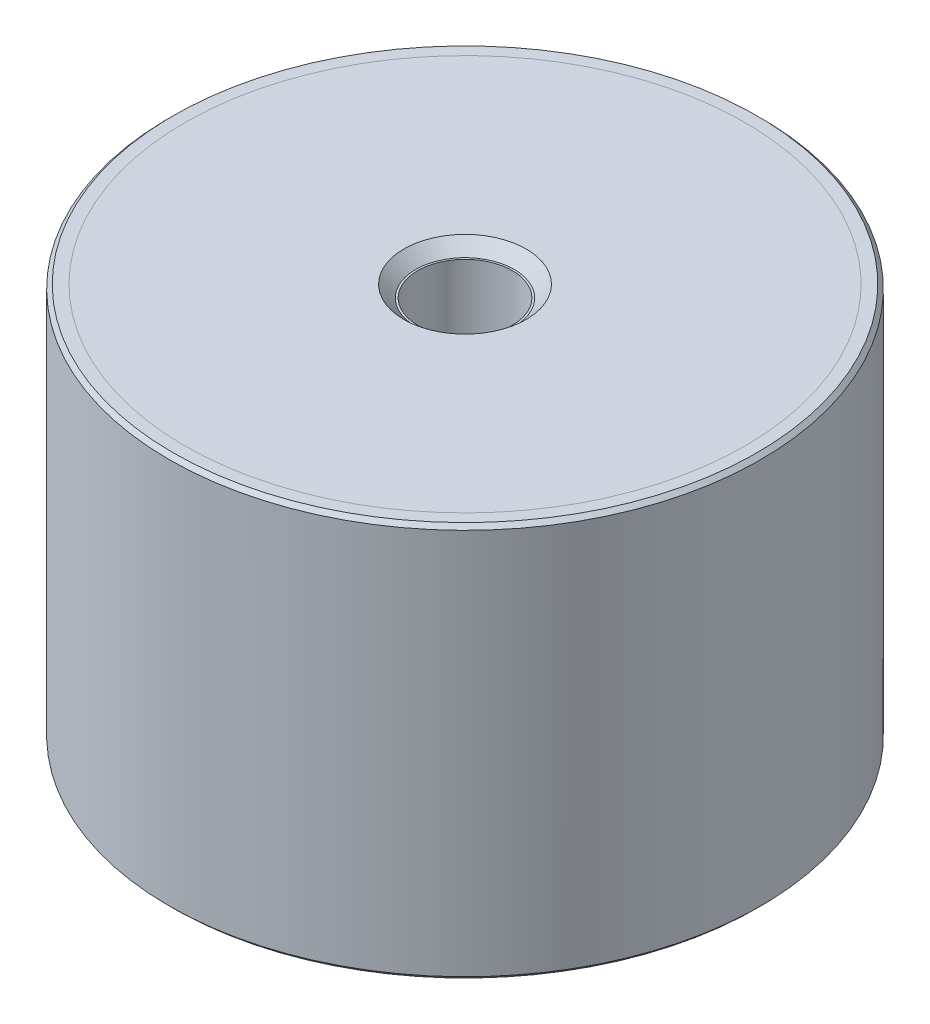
ISO-10303-21;
HEADER;
FILE_DESCRIPTION(('STEP AP214'),'2;1');
FILE_NAME('part.step','',(''),(''),'','','');
FILE_SCHEMA(('AUTOMOTIVE_DESIGN { 1 0 10303 214 1 1 1 1 }'));
ENDSEC;
DATA;
#1=APPLICATION_CONTEXT('core data for automotive mechanical design processes');
#2=APPLICATION_PROTOCOL_DEFINITION('international standard','automotive_design',2000,#1);
#3=PRODUCT_CONTEXT('',#1,'mechanical');
#4=PRODUCT('Part','Part','',(#3));
#5=PRODUCT_RELATED_PRODUCT_CATEGORY('part','',(#4));
#6=PRODUCT_DEFINITION_FORMATION('','',#4);
#7=PRODUCT_DEFINITION_CONTEXT('part definition',#1,'design');
#8=PRODUCT_DEFINITION('design','',#6,#7);
#9=PRODUCT_DEFINITION_SHAPE('','',#8);
#10=(LENGTH_UNIT() NAMED_UNIT(*) SI_UNIT(.MILLI.,.METRE.));
#11=(NAMED_UNIT(*) PLANE_ANGLE_UNIT() SI_UNIT($,.RADIAN.));
#12=(NAMED_UNIT(*) SI_UNIT($,.STERADIAN.) SOLID_ANGLE_UNIT());
#13=UNCERTAINTY_MEASURE_WITH_UNIT(LENGTH_MEASURE(1.E-05),#10,'distance_accuracy_value','');
#14=(GEOMETRIC_REPRESENTATION_CONTEXT(3) GLOBAL_UNCERTAINTY_ASSIGNED_CONTEXT((#13)) GLOBAL_UNIT_ASSIGNED_CONTEXT((#10,
#11,#12)) REPRESENTATION_CONTEXT('',''));
#15=CARTESIAN_POINT('',(0.,0.,0.));
#16=DIRECTION('',(0.,0.,1.));
#17=DIRECTION('',(1.,0.,0.));
#18=AXIS2_PLACEMENT_3D('',#15,#16,#17);
#19=CARTESIAN_POINT('',(0.,-47.,6.));
#20=DIRECTION('',(0.,1.,0.));
#21=DIRECTION('',(0.,0.,1.));
#22=AXIS2_PLACEMENT_3D('',#19,#20,#21);
#23=PLANE('',#22);
#24=CARTESIAN_POINT('',(0.,-47.,0.));
#25=DIRECTION('',(0.,1.,0.));
#26=DIRECTION('',(0.,0.,1.));
#27=AXIS2_PLACEMENT_3D('',#24,#25,#26);
#28=CIRCLE('',#27,6.25000000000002);
#29=CARTESIAN_POINT('',(0.,-47.,6.25000000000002));
#30=VERTEX_POINT('',#29);
#31=EDGE_CURVE('P0_E10',#30,#30,#28,.F.);
#32=ORIENTED_EDGE('',*,*,#31,.T.);
#33=EDGE_LOOP('',(#32));
#34=FACE_BOUND('',#33,.T.);
#35=CARTESIAN_POINT('',(0.,-47.,0.));
#36=DIRECTION('',(0.,1.,0.));
#37=DIRECTION('',(0.,0.,1.));
#38=AXIS2_PLACEMENT_3D('',#35,#36,#37);
#39=CIRCLE('',#38,35.5);
#40=CARTESIAN_POINT('',(0.,-47.,35.5));
#41=VERTEX_POINT('',#40);
#42=EDGE_CURVE('P0_E25',#41,#41,#39,.T.);
#43=ORIENTED_EDGE('',*,*,#42,.T.);
#44=EDGE_LOOP('',(#43));
#45=FACE_BOUND('',#44,.T.);
#46=ADVANCED_FACE('P0_F14',(#34,#45),#23,.T.);
#47=CARTESIAN_POINT('',(0.,21.0340428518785,0.));
#48=DIRECTION('',(0.,1.,0.));
#49=DIRECTION('',(0.,0.,1.));
#50=AXIS2_PLACEMENT_3D('',#47,#48,#49);
#51=CYLINDRICAL_SURFACE('',#50,35.5);
#52=CARTESIAN_POINT('',(0.,-48.5,0.));
#53=DIRECTION('',(0.,1.,0.));
#54=DIRECTION('',(0.,0.,1.));
#55=AXIS2_PLACEMENT_3D('',#52,#53,#54);
#56=CIRCLE('',#55,35.5);
#57=CARTESIAN_POINT('',(0.,-48.5,35.5));
#58=VERTEX_POINT('',#57);
#59=EDGE_CURVE('P0_E29',#58,#58,#56,.T.);
#60=ORIENTED_EDGE('',*,*,#59,.T.);
#61=EDGE_LOOP('',(#60));
#62=FACE_BOUND('',#61,.T.);
#63=ORIENTED_EDGE('',*,*,#42,.F.);
#64=EDGE_LOOP('',(#63));
#65=FACE_BOUND('',#64,.T.);
#66=ADVANCED_FACE('P0_F35',(#62,#65),#51,.T.);
#67=CARTESIAN_POINT('',(0.,-48.5,35.5));
#68=DIRECTION('',(0.,-1.,0.));
#69=DIRECTION('',(0.,0.,-1.));
#70=AXIS2_PLACEMENT_3D('',#67,#68,#69);
#71=PLANE('',#70);
#72=CARTESIAN_POINT('',(0.,-48.5,0.));
#73=DIRECTION('',(0.,-1.,0.));
#74=DIRECTION('',(0.,0.,-1.));
#75=AXIS2_PLACEMENT_3D('',#72,#73,#74);
#76=CIRCLE('',#75,7.75000000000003);
#77=CARTESIAN_POINT('',(0.,-48.5,-7.75000000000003));
#78=VERTEX_POINT('',#77);
#79=EDGE_CURVE('P0_E21',#78,#78,#76,.F.);
#80=ORIENTED_EDGE('',*,*,#79,.T.);
#81=EDGE_LOOP('',(#80));
#82=FACE_BOUND('',#81,.T.);
#83=ORIENTED_EDGE('',*,*,#59,.F.);
#84=EDGE_LOOP('',(#83));
#85=FACE_BOUND('',#84,.T.);
#86=ADVANCED_FACE('P0_F38',(#82,#85),#71,.T.);
#87=CARTESIAN_POINT('',(0.,-48.5,0.));
#88=DIRECTION('',(0.,-1.,0.));
#89=DIRECTION('',(0.,0.,-1.));
#90=AXIS2_PLACEMENT_3D('',#87,#88,#89);
#91=CONICAL_SURFACE('',#90,7.75000000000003,0.785398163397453);
#92=ORIENTED_EDGE('',*,*,#31,.F.);
#93=EDGE_LOOP('',(#92));
#94=FACE_BOUND('',#93,.T.);
#95=ORIENTED_EDGE('',*,*,#79,.F.);
#96=EDGE_LOOP('',(#95));
#97=FACE_BOUND('',#96,.T.);
#98=ADVANCED_FACE('P0_F16',(#94,#97),#91,.F.);
#99=CLOSED_SHELL('',(#46,#66,#86,#98));
#100=MANIFOLD_SOLID_BREP('P0_B1',#99);
#101=CARTESIAN_POINT('',(0.,1.5,6.));
#102=DIRECTION('',(0.,1.,0.));
#103=DIRECTION('',(0.,0.,1.));
#104=AXIS2_PLACEMENT_3D('',#101,#102,#103);
#105=PLANE('',#104);
#106=CARTESIAN_POINT('',(0.,1.5,0.));
#107=DIRECTION('',(0.,1.,0.));
#108=DIRECTION('',(0.,0.,1.));
#109=AXIS2_PLACEMENT_3D('',#106,#107,#108);
#110=CIRCLE('',#109,7.75000000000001);
#111=CARTESIAN_POINT('',(0.,1.5,7.75000000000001));
#112=VERTEX_POINT('',#111);
#113=EDGE_CURVE('P1_E10',#112,#112,#110,.F.);
#114=ORIENTED_EDGE('',*,*,#113,.T.);
#115=EDGE_LOOP('',(#114));
#116=FACE_BOUND('',#115,.T.);
#117=CARTESIAN_POINT('',(0.,1.5,0.));
#118=DIRECTION('',(0.,1.,0.));
#119=DIRECTION('',(0.,0.,1.));
#120=AXIS2_PLACEMENT_3D('',#117,#118,#119);
#121=CIRCLE('',#120,35.5);
#122=CARTESIAN_POINT('',(0.,1.5,35.5));
#123=VERTEX_POINT('',#122);
#124=EDGE_CURVE('P1_E25',#123,#123,#121,.T.);
#125=ORIENTED_EDGE('',*,*,#124,.T.);
#126=EDGE_LOOP('',(#125));
#127=FACE_BOUND('',#126,.T.);
#128=ADVANCED_FACE('P1_F14',(#116,#127),#105,.T.);
#129=CARTESIAN_POINT('',(0.,69.5340428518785,0.));
#130=DIRECTION('',(0.,1.,0.));
#131=DIRECTION('',(0.,0.,1.));
#132=AXIS2_PLACEMENT_3D('',#129,#130,#131);
#133=CYLINDRICAL_SURFACE('',#132,35.5);
#134=CARTESIAN_POINT('',(0.,0.,0.));
#135=DIRECTION('',(0.,1.,0.));
#136=DIRECTION('',(0.,0.,1.));
#137=AXIS2_PLACEMENT_3D('',#134,#135,#136);
#138=CIRCLE('',#137,35.5);
#139=CARTESIAN_POINT('',(0.,0.,35.5));
#140=VERTEX_POINT('',#139);
#141=EDGE_CURVE('P1_E29',#140,#140,#138,.T.);
#142=ORIENTED_EDGE('',*,*,#141,.T.);
#143=EDGE_LOOP('',(#142));
#144=FACE_BOUND('',#143,.T.);
#145=ORIENTED_EDGE('',*,*,#124,.F.);
#146=EDGE_LOOP('',(#145));
#147=FACE_BOUND('',#146,.T.);
#148=ADVANCED_FACE('P1_F35',(#144,#147),#133,.T.);
#149=CARTESIAN_POINT('',(0.,0.,35.5));
#150=DIRECTION('',(0.,-1.,0.));
#151=DIRECTION('',(0.,0.,-1.));
#152=AXIS2_PLACEMENT_3D('',#149,#150,#151);
#153=PLANE('',#152);
#154=CARTESIAN_POINT('',(0.,0.,0.));
#155=DIRECTION('',(0.,-1.,0.));
#156=DIRECTION('',(0.,0.,-1.));
#157=AXIS2_PLACEMENT_3D('',#154,#155,#156);
#158=CIRCLE('',#157,6.25000000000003);
#159=CARTESIAN_POINT('',(0.,0.,-6.25000000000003));
#160=VERTEX_POINT('',#159);
#161=EDGE_CURVE('P1_E21',#160,#160,#158,.F.);
#162=ORIENTED_EDGE('',*,*,#161,.T.);
#163=EDGE_LOOP('',(#162));
#164=FACE_BOUND('',#163,.T.);
#165=ORIENTED_EDGE('',*,*,#141,.F.);
#166=EDGE_LOOP('',(#165));
#167=FACE_BOUND('',#166,.T.);
#168=ADVANCED_FACE('P1_F38',(#164,#167),#153,.T.);
#169=CARTESIAN_POINT('',(0.,-0.250000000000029,0.));
#170=DIRECTION('',(0.,1.,0.));
#171=DIRECTION('',(0.,0.,1.));
#172=AXIS2_PLACEMENT_3D('',#169,#170,#171);
#173=CONICAL_SURFACE('',#172,6.,0.785398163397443);
#174=ORIENTED_EDGE('',*,*,#113,.F.);
#175=EDGE_LOOP('',(#174));
#176=FACE_BOUND('',#175,.T.);
#177=ORIENTED_EDGE('',*,*,#161,.F.);
#178=EDGE_LOOP('',(#177));
#179=FACE_BOUND('',#178,.T.);
#180=ADVANCED_FACE('P1_F16',(#176,#179),#173,.F.);
#181=CLOSED_SHELL('',(#128,#148,#168,#180));
#182=MANIFOLD_SOLID_BREP('P1_B1',#181);
#183=CARTESIAN_POINT('',(0.,0.,0.));
#184=DIRECTION('',(0.,1.,0.));
#185=DIRECTION('',(0.,0.,1.));
#186=AXIS2_PLACEMENT_3D('',#183,#184,#185);
#187=PLANE('',#186);
#188=CARTESIAN_POINT('',(0.,0.,0.));
#189=DIRECTION('',(0.,1.,0.));
#190=DIRECTION('',(0.,0.,1.));
#191=AXIS2_PLACEMENT_3D('',#188,#189,#190);
#192=CIRCLE('',#191,6.);
#193=CARTESIAN_POINT('',(0.,0.,6.));
#194=VERTEX_POINT('',#193);
#195=EDGE_CURVE('P2_E46',#194,#194,#192,.T.);
#196=ORIENTED_EDGE('',*,*,#195,.F.);
#197=EDGE_LOOP('',(#196));
#198=FACE_BOUND('',#197,.T.);
#199=CARTESIAN_POINT('',(0.,0.,0.));
#200=DIRECTION('',(0.,1.,0.));
#201=DIRECTION('',(0.,0.,1.));
#202=AXIS2_PLACEMENT_3D('',#199,#200,#201);
#203=CIRCLE('',#202,35.5);
#204=CARTESIAN_POINT('',(0.,0.,35.5));
#205=VERTEX_POINT('',#204);
#206=EDGE_CURVE('P2_E33',#205,#205,#203,.T.);
#207=ORIENTED_EDGE('',*,*,#206,.T.);
#208=EDGE_LOOP('',(#207));
#209=FACE_BOUND('',#208,.T.);
#210=ADVANCED_FACE('P2_F13',(#198,#209),#187,.T.);
#211=CARTESIAN_POINT('',(0.,65.5134936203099,0.));
#212=DIRECTION('',(0.,1.,0.));
#213=DIRECTION('',(0.,0.,1.));
#214=AXIS2_PLACEMENT_3D('',#211,#212,#213);
#215=CYLINDRICAL_SURFACE('',#214,35.5);
#216=CARTESIAN_POINT('',(0.,1.5,0.));
#217=DIRECTION('',(0.,1.,0.));
#218=DIRECTION('',(0.,0.,1.));
#219=AXIS2_PLACEMENT_3D('',#216,#217,#218);
#220=CIRCLE('',#219,35.5);
#221=CARTESIAN_POINT('',(0.,1.5,35.5));
#222=VERTEX_POINT('',#221);
#223=EDGE_CURVE('P2_E36',#222,#222,#220,.T.);
#224=ORIENTED_EDGE('',*,*,#223,.T.);
#225=EDGE_LOOP('',(#224));
#226=FACE_BOUND('',#225,.T.);
#227=ORIENTED_EDGE('',*,*,#206,.F.);
#228=EDGE_LOOP('',(#227));
#229=FACE_BOUND('',#228,.T.);
#230=ADVANCED_FACE('P2_F92',(#226,#229),#215,.F.);
#231=CARTESIAN_POINT('',(0.,1.5,35.5));
#232=DIRECTION('',(0.,1.,0.));
#233=DIRECTION('',(0.,0.,1.));
#234=AXIS2_PLACEMENT_3D('',#231,#232,#233);
#235=PLANE('',#234);
#236=CARTESIAN_POINT('',(0.,1.5,0.));
#237=DIRECTION('',(0.,1.,0.));
#238=DIRECTION('',(0.,0.,1.));
#239=AXIS2_PLACEMENT_3D('',#236,#237,#238);
#240=CIRCLE('',#239,37.);
#241=CARTESIAN_POINT('',(0.,1.5,37.));
#242=VERTEX_POINT('',#241);
#243=EDGE_CURVE('P2_E9',#242,#242,#240,.T.);
#244=ORIENTED_EDGE('',*,*,#243,.T.);
#245=EDGE_LOOP('',(#244));
#246=FACE_BOUND('',#245,.T.);
#247=ORIENTED_EDGE('',*,*,#223,.F.);
#248=EDGE_LOOP('',(#247));
#249=FACE_BOUND('',#248,.T.);
#250=ADVANCED_FACE('P2_F88',(#246,#249),#235,.T.);
#251=CARTESIAN_POINT('',(0.,65.5134936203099,0.));
#252=DIRECTION('',(0.,1.,0.));
#253=DIRECTION('',(0.,0.,1.));
#254=AXIS2_PLACEMENT_3D('',#251,#252,#253);
#255=CYLINDRICAL_SURFACE('',#254,37.5);
#256=CARTESIAN_POINT('',(0.,-48.,0.));
#257=DIRECTION('',(0.,-1.,0.));
#258=DIRECTION('',(0.,0.,-1.));
#259=AXIS2_PLACEMENT_3D('',#256,#257,#258);
#260=CIRCLE('',#259,37.5);
#261=CARTESIAN_POINT('',(0.,-48.,-37.5));
#262=VERTEX_POINT('',#261);
#263=EDGE_CURVE('P2_E24',#262,#262,#260,.F.);
#264=ORIENTED_EDGE('',*,*,#263,.T.);
#265=EDGE_LOOP('',(#264));
#266=FACE_BOUND('',#265,.T.);
#267=CARTESIAN_POINT('',(0.,1.00000000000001,0.));
#268=DIRECTION('',(0.,1.,0.));
#269=DIRECTION('',(0.,0.,1.));
#270=AXIS2_PLACEMENT_3D('',#267,#268,#269);
#271=CIRCLE('',#270,37.5);
#272=CARTESIAN_POINT('',(0.,1.00000000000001,37.5));
#273=VERTEX_POINT('',#272);
#274=EDGE_CURVE('P2_E28',#273,#273,#271,.F.);
#275=ORIENTED_EDGE('',*,*,#274,.T.);
#276=EDGE_LOOP('',(#275));
#277=FACE_BOUND('',#276,.T.);
#278=ADVANCED_FACE('P2_F82',(#266,#277),#255,.T.);
#279=CARTESIAN_POINT('',(0.,-48.5,37.5));
#280=DIRECTION('',(0.,-1.,0.));
#281=DIRECTION('',(0.,0.,-1.));
#282=AXIS2_PLACEMENT_3D('',#279,#280,#281);
#283=PLANE('',#282);
#284=CARTESIAN_POINT('',(0.,-48.5,0.));
#285=DIRECTION('',(0.,-1.,0.));
#286=DIRECTION('',(0.,0.,-1.));
#287=AXIS2_PLACEMENT_3D('',#284,#285,#286);
#288=CIRCLE('',#287,37.);
#289=CARTESIAN_POINT('',(0.,-48.5,-37.));
#290=VERTEX_POINT('',#289);
#291=EDGE_CURVE('P2_E20',#290,#290,#288,.T.);
#292=ORIENTED_EDGE('',*,*,#291,.T.);
#293=EDGE_LOOP('',(#292));
#294=FACE_BOUND('',#293,.T.);
#295=CARTESIAN_POINT('',(0.,-48.5,0.));
#296=DIRECTION('',(0.,1.,0.));
#297=DIRECTION('',(0.,0.,1.));
#298=AXIS2_PLACEMENT_3D('',#295,#296,#297);
#299=CIRCLE('',#298,35.5);
#300=CARTESIAN_POINT('',(0.,-48.5,35.5));
#301=VERTEX_POINT('',#300);
#302=EDGE_CURVE('P2_E39',#301,#301,#299,.T.);
#303=ORIENTED_EDGE('',*,*,#302,.T.);
#304=EDGE_LOOP('',(#303));
#305=FACE_BOUND('',#304,.T.);
#306=ADVANCED_FACE('P2_F77',(#294,#305),#283,.T.);
#307=CARTESIAN_POINT('',(0.,65.5134936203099,0.));
#308=DIRECTION('',(0.,1.,0.));
#309=DIRECTION('',(0.,0.,1.));
#310=AXIS2_PLACEMENT_3D('',#307,#308,#309);
#311=CYLINDRICAL_SURFACE('',#310,35.5);
#312=CARTESIAN_POINT('',(0.,-47.,0.));
#313=DIRECTION('',(0.,1.,0.));
#314=DIRECTION('',(0.,0.,1.));
#315=AXIS2_PLACEMENT_3D('',#312,#313,#314);
#316=CIRCLE('',#315,35.5);
#317=CARTESIAN_POINT('',(0.,-47.,35.5));
#318=VERTEX_POINT('',#317);
#319=EDGE_CURVE('P2_E42',#318,#318,#316,.T.);
#320=ORIENTED_EDGE('',*,*,#319,.T.);
#321=EDGE_LOOP('',(#320));
#322=FACE_BOUND('',#321,.T.);
#323=ORIENTED_EDGE('',*,*,#302,.F.);
#324=EDGE_LOOP('',(#323));
#325=FACE_BOUND('',#324,.T.);
#326=ADVANCED_FACE('P2_F71',(#322,#325),#311,.F.);
#327=CARTESIAN_POINT('',(0.,-47.,35.5));
#328=DIRECTION('',(0.,-1.,0.));
#329=DIRECTION('',(0.,0.,-1.));
#330=AXIS2_PLACEMENT_3D('',#327,#328,#329);
#331=PLANE('',#330);
#332=CARTESIAN_POINT('',(0.,-47.,0.));
#333=DIRECTION('',(0.,-1.,0.));
#334=DIRECTION('',(0.,0.,-1.));
#335=AXIS2_PLACEMENT_3D('',#332,#333,#334);
#336=CIRCLE('',#335,6.);
#337=CARTESIAN_POINT('',(0.,-47.,-6.));
#338=VERTEX_POINT('',#337);
#339=EDGE_CURVE('P2_E52',#338,#338,#336,.T.);
#340=ORIENTED_EDGE('',*,*,#339,.F.);
#341=EDGE_LOOP('',(#340));
#342=FACE_BOUND('',#341,.T.);
#343=ORIENTED_EDGE('',*,*,#319,.F.);
#344=EDGE_LOOP('',(#343));
#345=FACE_BOUND('',#344,.T.);
#346=ADVANCED_FACE('P2_F67',(#342,#345),#331,.T.);
#347=CARTESIAN_POINT('',(0.,-48.,0.));
#348=DIRECTION('',(0.,1.,0.));
#349=DIRECTION('',(0.,0.,1.));
#350=AXIS2_PLACEMENT_3D('',#347,#348,#349);
#351=CONICAL_SURFACE('',#350,37.5,0.785398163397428);
#352=ORIENTED_EDGE('',*,*,#291,.F.);
#353=EDGE_LOOP('',(#352));
#354=FACE_BOUND('',#353,.T.);
#355=ORIENTED_EDGE('',*,*,#263,.F.);
#356=EDGE_LOOP('',(#355));
#357=FACE_BOUND('',#356,.T.);
#358=ADVANCED_FACE('P2_F70',(#354,#357),#351,.T.);
#359=CARTESIAN_POINT('',(0.,1.5,0.));
#360=DIRECTION('',(0.,-1.,0.));
#361=DIRECTION('',(0.,0.,-1.));
#362=AXIS2_PLACEMENT_3D('',#359,#360,#361);
#363=CONICAL_SURFACE('',#362,37.,0.785398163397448);
#364=ORIENTED_EDGE('',*,*,#274,.F.);
#365=EDGE_LOOP('',(#364));
#366=FACE_BOUND('',#365,.T.);
#367=ORIENTED_EDGE('',*,*,#243,.F.);
#368=EDGE_LOOP('',(#367));
#369=FACE_BOUND('',#368,.T.);
#370=ADVANCED_FACE('P2_F15',(#366,#369),#363,.T.);
#371=CARTESIAN_POINT('',(0.,-10.5,0.));
#372=DIRECTION('',(0.,1.,0.));
#373=DIRECTION('',(0.,0.,1.));
#374=AXIS2_PLACEMENT_3D('',#371,#372,#373);
#375=CYLINDRICAL_SURFACE('',#374,6.);
#376=CARTESIAN_POINT('',(0.,-10.5,0.));
#377=DIRECTION('',(0.,1.,0.));
#378=DIRECTION('',(0.,0.,1.));
#379=AXIS2_PLACEMENT_3D('',#376,#377,#378);
#380=CIRCLE('',#379,6.);
#381=CARTESIAN_POINT('',(0.,-10.5,6.));
#382=VERTEX_POINT('',#381);
#383=EDGE_CURVE('P2_E45',#382,#382,#380,.T.);
#384=CARTESIAN_POINT('',(0.,-10.5,6.));
#385=CARTESIAN_POINT('',(0.,-10.390625,6.));
#386=CARTESIAN_POINT('',(0.,-10.28125,6.));
#387=CARTESIAN_POINT('',(0.,-10.0625,6.));
#388=CARTESIAN_POINT('',(0.,-9.953125,6.));
#389=CARTESIAN_POINT('',(0.,-9.734375,6.));
#390=CARTESIAN_POINT('',(0.,-9.625,6.));
#391=CARTESIAN_POINT('',(0.,-9.40625,6.));
#392=CARTESIAN_POINT('',(0.,-9.296875,6.));
#393=CARTESIAN_POINT('',(0.,-9.078125,6.));
#394=CARTESIAN_POINT('',(0.,-8.96875,6.));
#395=CARTESIAN_POINT('',(0.,-8.75,6.));
#396=CARTESIAN_POINT('',(0.,-8.640625,6.));
#397=CARTESIAN_POINT('',(0.,-8.421875,6.));
#398=CARTESIAN_POINT('',(0.,-8.3125,6.));
#399=CARTESIAN_POINT('',(0.,-8.09375,6.));
#400=CARTESIAN_POINT('',(0.,-7.984375,6.));
#401=CARTESIAN_POINT('',(0.,-7.765625,6.));
#402=CARTESIAN_POINT('',(0.,-7.65625,6.));
#403=CARTESIAN_POINT('',(0.,-7.4375,6.));
#404=CARTESIAN_POINT('',(0.,-7.328125,6.));
#405=CARTESIAN_POINT('',(0.,-7.109375,6.));
#406=CARTESIAN_POINT('',(0.,-7.,6.));
#407=CARTESIAN_POINT('',(0.,-6.78125,6.));
#408=CARTESIAN_POINT('',(0.,-6.671875,6.));
#409=CARTESIAN_POINT('',(0.,-6.453125,6.));
#410=CARTESIAN_POINT('',(0.,-6.34375,6.));
#411=CARTESIAN_POINT('',(0.,-6.125,6.));
#412=CARTESIAN_POINT('',(0.,-6.015625,6.));
#413=CARTESIAN_POINT('',(0.,-5.796875,6.));
#414=CARTESIAN_POINT('',(0.,-5.6875,6.));
#415=CARTESIAN_POINT('',(0.,-5.46875,6.));
#416=CARTESIAN_POINT('',(0.,-5.359375,6.));
#417=CARTESIAN_POINT('',(0.,-5.140625,6.));
#418=CARTESIAN_POINT('',(0.,-5.03125,6.));
#419=CARTESIAN_POINT('',(0.,-4.8125,6.));
#420=CARTESIAN_POINT('',(0.,-4.703125,6.));
#421=CARTESIAN_POINT('',(0.,-4.484375,6.));
#422=CARTESIAN_POINT('',(0.,-4.375,6.));
#423=CARTESIAN_POINT('',(0.,-4.15625,6.));
#424=CARTESIAN_POINT('',(0.,-4.046875,6.));
#425=CARTESIAN_POINT('',(0.,-3.828125,6.));
#426=CARTESIAN_POINT('',(0.,-3.71875,6.));
#427=CARTESIAN_POINT('',(0.,-3.5,6.));
#428=CARTESIAN_POINT('',(0.,-3.390625,6.));
#429=CARTESIAN_POINT('',(0.,-3.171875,6.));
#430=CARTESIAN_POINT('',(0.,-3.0625,6.));
#431=CARTESIAN_POINT('',(0.,-2.84375,6.));
#432=CARTESIAN_POINT('',(0.,-2.734375,6.));
#433=CARTESIAN_POINT('',(0.,-2.515625,6.));
#434=CARTESIAN_POINT('',(0.,-2.40625,6.));
#435=CARTESIAN_POINT('',(0.,-2.1875,6.));
#436=CARTESIAN_POINT('',(0.,-2.078125,6.));
#437=CARTESIAN_POINT('',(0.,-1.859375,6.));
#438=CARTESIAN_POINT('',(0.,-1.75,6.));
#439=CARTESIAN_POINT('',(0.,-1.53125,6.));
#440=CARTESIAN_POINT('',(0.,-1.421875,6.));
#441=CARTESIAN_POINT('',(0.,-1.203125,6.));
#442=CARTESIAN_POINT('',(0.,-1.09375,6.));
#443=CARTESIAN_POINT('',(0.,-0.875000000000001,6.));
#444=CARTESIAN_POINT('',(0.,-0.765625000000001,6.));
#445=CARTESIAN_POINT('',(0.,-0.546875,6.));
#446=CARTESIAN_POINT('',(0.,-0.4375,6.));
#447=CARTESIAN_POINT('',(0.,-0.21875,6.));
#448=CARTESIAN_POINT('',(0.,-0.109375,6.));
#449=CARTESIAN_POINT('',(0.,0.,6.));
#450=B_SPLINE_CURVE_WITH_KNOTS('',3,(#384,#385,#386,#387,#388,#389,#390,#391,#392,#393,#394,
#395,#396,#397,#398,#399,#400,#401,#402,#403,#404,#405,#406,#407,#408,#409,#410,#411,#412,#413,
#414,#415,#416,#417,#418,#419,#420,#421,#422,#423,#424,#425,#426,#427,#428,#429,#430,#431,#432,
#433,#434,#435,#436,#437,#438,#439,#440,#441,#442,#443,#444,#445,#446,#447,#448,#449),
.UNSPECIFIED.,.F.,.F.,(4,2,2,2,2,2,2,2,2,2,2,2,2,2,2,2,2,2,2,2,2,2,2,2,2,2,2,2,2,2,2,2,4),(0.,
0.328124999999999,0.656249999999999,0.984374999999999,1.3125,1.640625,1.96875,2.296875,2.625,
2.953125,3.28125,3.609375,3.9375,4.265625,4.59375,4.921875,5.25,5.578125,5.90625,6.234375,
6.5625,6.890625,7.21875,7.546875,7.875,8.203125,8.53125,8.859375,9.1875,9.515625,9.84375,
10.171875,10.5),.UNSPECIFIED.);
#451=EDGE_CURVE('P2_BSEAM108',#382,#194,#450,.T.);
#452=ORIENTED_EDGE('',*,*,#383,.F.);
#453=ORIENTED_EDGE('',*,*,#195,.T.);
#454=ORIENTED_EDGE('',*,*,#451,.T.);
#455=ORIENTED_EDGE('',*,*,#451,.F.);
#456=EDGE_LOOP('',(#452,#454,#453,#455));
#457=FACE_BOUND('',#456,.T.);
#458=ADVANCED_FACE('P2_F108',(#457),#375,.F.);
#459=CARTESIAN_POINT('',(0.,-10.5,0.));
#460=DIRECTION('',(0.,1.,0.));
#461=DIRECTION('',(0.,0.,1.));
#462=AXIS2_PLACEMENT_3D('',#459,#460,#461);
#463=PLANE('',#462);
#464=ORIENTED_EDGE('',*,*,#383,.T.);
#465=EDGE_LOOP('',(#464));
#466=FACE_BOUND('',#465,.T.);
#467=ADVANCED_FACE('P2_F63',(#466),#463,.T.);
#468=CARTESIAN_POINT('',(0.,-36.5,0.));
#469=DIRECTION('',(0.,-1.,0.));
#470=DIRECTION('',(0.,0.,-1.));
#471=AXIS2_PLACEMENT_3D('',#468,#469,#470);
#472=CYLINDRICAL_SURFACE('',#471,6.);
#473=CARTESIAN_POINT('',(0.,-36.5,0.));
#474=DIRECTION('',(0.,-1.,0.));
#475=DIRECTION('',(0.,0.,-1.));
#476=AXIS2_PLACEMENT_3D('',#473,#474,#475);
#477=CIRCLE('',#476,6.);
#478=CARTESIAN_POINT('',(0.,-36.5,-6.));
#479=VERTEX_POINT('',#478);
#480=EDGE_CURVE('P2_E49',#479,#479,#477,.T.);
#481=CARTESIAN_POINT('',(0.,-36.5,-6.));
#482=CARTESIAN_POINT('',(0.,-36.609375,-6.));
#483=CARTESIAN_POINT('',(0.,-36.71875,-6.));
#484=CARTESIAN_POINT('',(0.,-36.9375,-6.));
#485=CARTESIAN_POINT('',(0.,-37.046875,-6.));
#486=CARTESIAN_POINT('',(0.,-37.265625,-6.));
#487=CARTESIAN_POINT('',(0.,-37.375,-6.));
#488=CARTESIAN_POINT('',(0.,-37.59375,-6.));
#489=CARTESIAN_POINT('',(0.,-37.703125,-6.));
#490=CARTESIAN_POINT('',(0.,-37.921875,-6.));
#491=CARTESIAN_POINT('',(0.,-38.03125,-6.));
#492=CARTESIAN_POINT('',(0.,-38.25,-6.));
#493=CARTESIAN_POINT('',(0.,-38.359375,-6.));
#494=CARTESIAN_POINT('',(0.,-38.578125,-6.));
#495=CARTESIAN_POINT('',(0.,-38.6875,-6.));
#496=CARTESIAN_POINT('',(0.,-38.90625,-6.));
#497=CARTESIAN_POINT('',(0.,-39.015625,-6.));
#498=CARTESIAN_POINT('',(0.,-39.234375,-6.));
#499=CARTESIAN_POINT('',(0.,-39.34375,-6.));
#500=CARTESIAN_POINT('',(0.,-39.5625,-6.));
#501=CARTESIAN_POINT('',(0.,-39.671875,-6.));
#502=CARTESIAN_POINT('',(0.,-39.890625,-6.));
#503=CARTESIAN_POINT('',(0.,-40.,-6.));
#504=CARTESIAN_POINT('',(0.,-40.21875,-6.));
#505=CARTESIAN_POINT('',(0.,-40.328125,-6.));
#506=CARTESIAN_POINT('',(0.,-40.546875,-6.));
#507=CARTESIAN_POINT('',(0.,-40.65625,-6.));
#508=CARTESIAN_POINT('',(0.,-40.875,-6.));
#509=CARTESIAN_POINT('',(0.,-40.984375,-6.));
#510=CARTESIAN_POINT('',(0.,-41.203125,-6.));
#511=CARTESIAN_POINT('',(0.,-41.3125,-6.));
#512=CARTESIAN_POINT('',(0.,-41.53125,-6.));
#513=CARTESIAN_POINT('',(0.,-41.640625,-6.));
#514=CARTESIAN_POINT('',(0.,-41.859375,-6.));
#515=CARTESIAN_POINT('',(0.,-41.96875,-6.));
#516=CARTESIAN_POINT('',(0.,-42.1875,-6.));
#517=CARTESIAN_POINT('',(0.,-42.296875,-6.));
#518=CARTESIAN_POINT('',(0.,-42.515625,-6.));
#519=CARTESIAN_POINT('',(0.,-42.625,-6.));
#520=CARTESIAN_POINT('',(0.,-42.84375,-6.));
#521=CARTESIAN_POINT('',(0.,-42.953125,-6.));
#522=CARTESIAN_POINT('',(0.,-43.171875,-6.));
#523=CARTESIAN_POINT('',(0.,-43.28125,-6.));
#524=CARTESIAN_POINT('',(0.,-43.5,-6.));
#525=CARTESIAN_POINT('',(0.,-43.609375,-6.));
#526=CARTESIAN_POINT('',(0.,-43.828125,-6.));
#527=CARTESIAN_POINT('',(0.,-43.9375,-6.));
#528=CARTESIAN_POINT('',(0.,-44.15625,-6.));
#529=CARTESIAN_POINT('',(0.,-44.265625,-6.));
#530=CARTESIAN_POINT('',(0.,-44.484375,-6.));
#531=CARTESIAN_POINT('',(0.,-44.59375,-6.));
#532=CARTESIAN_POINT('',(0.,-44.8125,-6.));
#533=CARTESIAN_POINT('',(0.,-44.921875,-6.));
#534=CARTESIAN_POINT('',(0.,-45.140625,-6.));
#535=CARTESIAN_POINT('',(0.,-45.25,-6.));
#536=CARTESIAN_POINT('',(0.,-45.46875,-6.));
#537=CARTESIAN_POINT('',(0.,-45.578125,-6.));
#538=CARTESIAN_POINT('',(0.,-45.796875,-6.));
#539=CARTESIAN_POINT('',(0.,-45.90625,-6.));
#540=CARTESIAN_POINT('',(0.,-46.125,-6.));
#541=CARTESIAN_POINT('',(0.,-46.234375,-6.));
#542=CARTESIAN_POINT('',(0.,-46.453125,-6.));
#543=CARTESIAN_POINT('',(0.,-46.5625,-6.));
#544=CARTESIAN_POINT('',(0.,-46.78125,-6.));
#545=CARTESIAN_POINT('',(0.,-46.890625,-6.));
#546=CARTESIAN_POINT('',(0.,-47.,-6.));
#547=B_SPLINE_CURVE_WITH_KNOTS('',3,(#481,#482,#483,#484,#485,#486,#487,#488,#489,#490,#491,
#492,#493,#494,#495,#496,#497,#498,#499,#500,#501,#502,#503,#504,#505,#506,#507,#508,#509,#510,
#511,#512,#513,#514,#515,#516,#517,#518,#519,#520,#521,#522,#523,#524,#525,#526,#527,#528,#529,
#530,#531,#532,#533,#534,#535,#536,#537,#538,#539,#540,#541,#542,#543,#544,#545,#546),
.UNSPECIFIED.,.F.,.F.,(4,2,2,2,2,2,2,2,2,2,2,2,2,2,2,2,2,2,2,2,2,2,2,2,2,2,2,2,2,2,2,2,4),(0.,
0.328124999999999,0.656249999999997,0.984374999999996,1.31249999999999,1.640625,1.96875,
2.296875,2.625,2.95312499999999,3.28125,3.609375,3.9375,4.26562499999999,4.59374999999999,
4.921875,5.25,5.578125,5.90624999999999,6.23437499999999,6.5625,6.890625,7.21875,
7.54687499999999,7.875,8.203125,8.53125,8.859375,9.18749999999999,9.51562499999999,9.84375,
10.171875,10.5),.UNSPECIFIED.);
#548=EDGE_CURVE('P2_BSEAM60',#479,#338,#547,.T.);
#549=ORIENTED_EDGE('',*,*,#480,.F.);
#550=ORIENTED_EDGE('',*,*,#339,.T.);
#551=ORIENTED_EDGE('',*,*,#548,.T.);
#552=ORIENTED_EDGE('',*,*,#548,.F.);
#553=EDGE_LOOP('',(#549,#551,#550,#552));
#554=FACE_BOUND('',#553,.T.);
#555=ADVANCED_FACE('P2_F60',(#554),#472,.F.);
#556=CARTESIAN_POINT('',(0.,-36.5,0.));
#557=DIRECTION('',(0.,-1.,0.));
#558=DIRECTION('',(0.,0.,-1.));
#559=AXIS2_PLACEMENT_3D('',#556,#557,#558);
#560=PLANE('',#559);
#561=ORIENTED_EDGE('',*,*,#480,.T.);
#562=EDGE_LOOP('',(#561));
#563=FACE_BOUND('',#562,.T.);
#564=ADVANCED_FACE('P2_F58',(#563),#560,.T.);
#565=CLOSED_SHELL('',(#210,#230,#250,#278,#306,#326,#346,#358,#370,#458,#467,#555,#564));
#566=MANIFOLD_SOLID_BREP('P2_B1',#565);
#567=ADVANCED_BREP_SHAPE_REPRESENTATION('',(#18,#100,#182,#566),#14);
#568=SHAPE_DEFINITION_REPRESENTATION(#9,#567);
ENDSEC;
END-ISO-10303-21;
